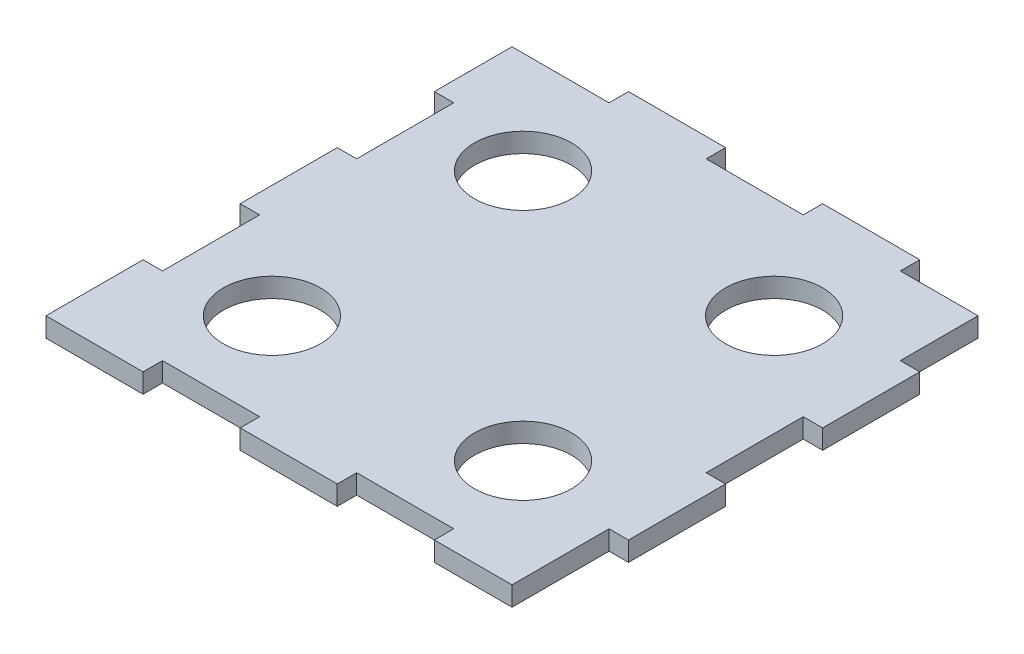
from build123d import *

# Parameters (mm, degrees)
SKETCH2_R           = 10
BOSS_EXTRUDE1_DEPTH = 4


with BuildPart() as part:
    # Sketch2 → Boss-Extrude1 (new body)
    with BuildSketch(Plane(origin=(0, 0, 0), x_dir=(1, 0, 0), z_dir=(0, 1, 0))):
        Polygon((-50, 46), (-30, 46), (-30, 50), (-10, 50), (-10, 46), (10, 46), (10, 50), (30, 50), (30, 46), (46, 46), (46, 30), (50, 30), (50, 10), (46, 10), (46, -10), (50, -10), (50, -30), (46, -30), (46, -50), (30, -50), (30, -46), (10, -46), (10, -50), (-10, -50), (-10, -46), (-30, -46), (-30, -50), (-50, -50), (-50, -30), (-46, -30), (-46, -10), (-50, -10), (-50, 10), (-46, 10), (-46, 30), (-50, 30), align=None)
        with Locations(Location((25, 25, 0), (0, 0, 270))):
            Circle(SKETCH2_R, mode=Mode.SUBTRACT)
        with Locations(Location((25, -26.732086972, 0), (0, 0, 270))):
            Circle(SKETCH2_R, mode=Mode.SUBTRACT)
        with Locations(Location((-26.732086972, -26.732086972, 0), (0, 0, 270))):
            Circle(SKETCH2_R, mode=Mode.SUBTRACT)
        with Locations(Location((-26.732086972, 25, 0), (0, 0, 270))):
            Circle(SKETCH2_R, mode=Mode.SUBTRACT)
    extrude(amount=BOSS_EXTRUDE1_DEPTH)


solid = part.part
